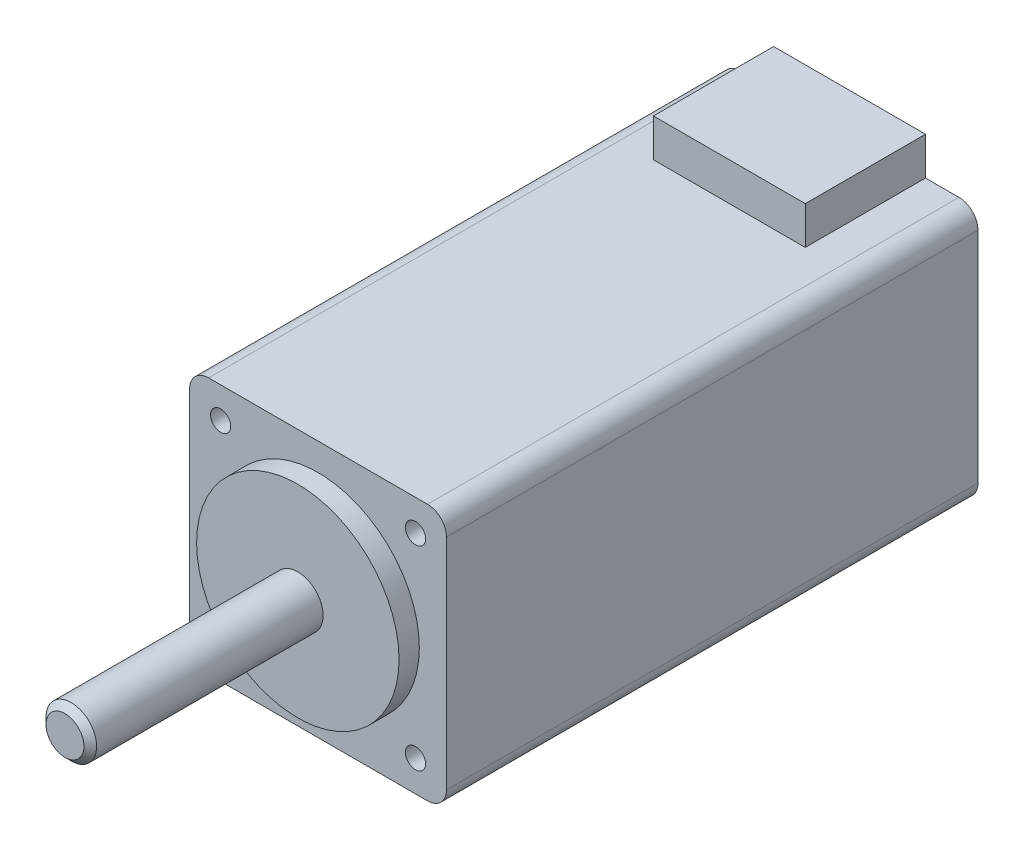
ISO-10303-21;
HEADER;
FILE_DESCRIPTION(('STEP AP214'),'2;1');
FILE_NAME('part.step','',(''),(''),'','','');
FILE_SCHEMA(('AUTOMOTIVE_DESIGN { 1 0 10303 214 1 1 1 1 }'));
ENDSEC;
DATA;
#1=APPLICATION_CONTEXT('core data for automotive mechanical design processes');
#2=APPLICATION_PROTOCOL_DEFINITION('international standard','automotive_design',2000,#1);
#3=PRODUCT_CONTEXT('',#1,'mechanical');
#4=PRODUCT('Part','Part','',(#3));
#5=PRODUCT_RELATED_PRODUCT_CATEGORY('part','',(#4));
#6=PRODUCT_DEFINITION_FORMATION('','',#4);
#7=PRODUCT_DEFINITION_CONTEXT('part definition',#1,'design');
#8=PRODUCT_DEFINITION('design','',#6,#7);
#9=PRODUCT_DEFINITION_SHAPE('','',#8);
#10=(LENGTH_UNIT() NAMED_UNIT(*) SI_UNIT(.MILLI.,.METRE.));
#11=(NAMED_UNIT(*) PLANE_ANGLE_UNIT() SI_UNIT($,.RADIAN.));
#12=(NAMED_UNIT(*) SI_UNIT($,.STERADIAN.) SOLID_ANGLE_UNIT());
#13=UNCERTAINTY_MEASURE_WITH_UNIT(LENGTH_MEASURE(1.E-05),#10,'distance_accuracy_value','');
#14=(GEOMETRIC_REPRESENTATION_CONTEXT(3) GLOBAL_UNCERTAINTY_ASSIGNED_CONTEXT((#13)) GLOBAL_UNIT_ASSIGNED_CONTEXT((#10,
#11,#12)) REPRESENTATION_CONTEXT('',''));
#15=CARTESIAN_POINT('',(0.,0.,0.));
#16=DIRECTION('',(0.,0.,1.));
#17=DIRECTION('',(1.,0.,0.));
#18=AXIS2_PLACEMENT_3D('',#15,#16,#17);
#19=CARTESIAN_POINT('',(0.,0.,0.));
#20=DIRECTION('',(0.,0.,1.));
#21=DIRECTION('',(1.,0.,0.));
#22=AXIS2_PLACEMENT_3D('',#19,#20,#21);
#23=PLANE('',#22);
#24=CARTESIAN_POINT('',(0.,0.,0.));
#25=DIRECTION('',(0.,0.,1.));
#26=DIRECTION('',(1.,0.,0.));
#27=AXIS2_PLACEMENT_3D('',#24,#25,#26);
#28=CIRCLE('',#27,8.);
#29=CARTESIAN_POINT('',(8.,0.,0.));
#30=VERTEX_POINT('',#29);
#31=EDGE_CURVE('E184',#30,#30,#28,.T.);
#32=ORIENTED_EDGE('',*,*,#31,.T.);
#33=EDGE_LOOP('',(#32));
#34=FACE_BOUND('',#33,.T.);
#35=CARTESIAN_POINT('',(0.,0.,0.));
#36=DIRECTION('',(0.,0.,1.));
#37=DIRECTION('',(1.,0.,0.));
#38=AXIS2_PLACEMENT_3D('',#35,#36,#37);
#39=CIRCLE('',#38,2.);
#40=CARTESIAN_POINT('',(2.,0.,0.));
#41=VERTEX_POINT('',#40);
#42=EDGE_CURVE('E181',#41,#41,#39,.T.);
#43=ORIENTED_EDGE('',*,*,#42,.F.);
#44=EDGE_LOOP('',(#43));
#45=FACE_BOUND('',#44,.T.);
#46=ADVANCED_FACE('F37',(#34,#45),#23,.T.);
#47=CARTESIAN_POINT('',(0.,0.,-1.6));
#48=DIRECTION('',(0.,0.,1.));
#49=DIRECTION('',(1.,0.,0.));
#50=AXIS2_PLACEMENT_3D('',#47,#48,#49);
#51=CYLINDRICAL_SURFACE('',#50,8.);
#52=CARTESIAN_POINT('',(0.,0.,-1.6));
#53=DIRECTION('',(0.,0.,1.));
#54=DIRECTION('',(1.,0.,0.));
#55=AXIS2_PLACEMENT_3D('',#52,#53,#54);
#56=CIRCLE('',#55,8.);
#57=CARTESIAN_POINT('',(8.,0.,-1.6));
#58=VERTEX_POINT('',#57);
#59=EDGE_CURVE('E178',#58,#58,#56,.F.);
#60=ORIENTED_EDGE('',*,*,#59,.F.);
#61=EDGE_LOOP('',(#60));
#62=FACE_BOUND('',#61,.T.);
#63=ORIENTED_EDGE('',*,*,#31,.F.);
#64=EDGE_LOOP('',(#63));
#65=FACE_BOUND('',#64,.T.);
#66=ADVANCED_FACE('F205',(#62,#65),#51,.T.);
#67=CARTESIAN_POINT('',(0.,0.,18.4));
#68=DIRECTION('',(0.,0.,-1.));
#69=DIRECTION('',(-1.,0.,0.));
#70=AXIS2_PLACEMENT_3D('',#67,#68,#69);
#71=CYLINDRICAL_SURFACE('',#70,2.);
#72=CARTESIAN_POINT('',(0.,0.,17.9));
#73=DIRECTION('',(0.,0.,1.));
#74=DIRECTION('',(1.,0.,0.));
#75=AXIS2_PLACEMENT_3D('',#72,#73,#74);
#76=CIRCLE('',#75,2.);
#77=CARTESIAN_POINT('',(2.,0.,17.9));
#78=VERTEX_POINT('',#77);
#79=EDGE_CURVE('E11',#78,#78,#76,.F.);
#80=ORIENTED_EDGE('',*,*,#79,.T.);
#81=EDGE_LOOP('',(#80));
#82=FACE_BOUND('',#81,.T.);
#83=ORIENTED_EDGE('',*,*,#42,.T.);
#84=EDGE_LOOP('',(#83));
#85=FACE_BOUND('',#84,.T.);
#86=ADVANCED_FACE('F201',(#82,#85),#71,.T.);
#87=CARTESIAN_POINT('',(0.,0.,18.4));
#88=DIRECTION('',(0.,0.,1.));
#89=DIRECTION('',(1.,0.,0.));
#90=AXIS2_PLACEMENT_3D('',#87,#88,#89);
#91=PLANE('',#90);
#92=CARTESIAN_POINT('',(0.,0.,18.4));
#93=DIRECTION('',(0.,0.,1.));
#94=DIRECTION('',(1.,0.,0.));
#95=AXIS2_PLACEMENT_3D('',#92,#93,#94);
#96=CIRCLE('',#95,1.5);
#97=CARTESIAN_POINT('',(1.5,0.,18.4));
#98=VERTEX_POINT('',#97);
#99=EDGE_CURVE('E45',#98,#98,#96,.T.);
#100=ORIENTED_EDGE('',*,*,#99,.T.);
#101=EDGE_LOOP('',(#100));
#102=FACE_BOUND('',#101,.T.);
#103=ADVANCED_FACE('F189',(#102),#91,.T.);
#104=CARTESIAN_POINT('',(0.,0.,18.4));
#105=DIRECTION('',(0.,0.,-1.));
#106=DIRECTION('',(-1.,0.,0.));
#107=AXIS2_PLACEMENT_3D('',#104,#105,#106);
#108=CONICAL_SURFACE('',#107,1.5,0.78539816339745);
#109=ORIENTED_EDGE('',*,*,#79,.F.);
#110=EDGE_LOOP('',(#109));
#111=FACE_BOUND('',#110,.T.);
#112=ORIENTED_EDGE('',*,*,#99,.F.);
#113=EDGE_LOOP('',(#112));
#114=FACE_BOUND('',#113,.T.);
#115=ADVANCED_FACE('F39',(#111,#114),#108,.T.);
#116=CARTESIAN_POINT('',(8.65,8.65,-43.6));
#117=DIRECTION('',(0.,0.,1.));
#118=DIRECTION('',(1.,0.,0.));
#119=AXIS2_PLACEMENT_3D('',#116,#117,#118);
#120=CYLINDRICAL_SURFACE('',#119,1.5);
#121=CARTESIAN_POINT('',(8.65,8.65,-1.6));
#122=DIRECTION('',(0.,0.,-1.));
#123=DIRECTION('',(1.,0.,0.));
#124=AXIS2_PLACEMENT_3D('',#121,#122,#123);
#125=CIRCLE('',#124,1.5);
#126=CARTESIAN_POINT('',(8.64999999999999,10.15,-1.6));
#127=VERTEX_POINT('',#126);
#128=CARTESIAN_POINT('',(10.15,8.64999999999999,-1.6));
#129=VERTEX_POINT('',#128);
#130=EDGE_CURVE('E148',#127,#129,#125,.T.);
#131=ORIENTED_EDGE('',*,*,#130,.T.);
#132=DIRECTION('',(0.,0.,1.));
#133=VECTOR('',#132,1.);
#134=CARTESIAN_POINT('',(10.15,8.64999999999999,-43.6));
#135=LINE('',#134,#133);
#136=CARTESIAN_POINT('',(10.15,8.64999999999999,-43.6));
#137=VERTEX_POINT('',#136);
#138=EDGE_CURVE('E172',#137,#129,#135,.T.);
#139=ORIENTED_EDGE('',*,*,#138,.F.);
#140=CARTESIAN_POINT('',(8.65,8.65,-43.6));
#141=DIRECTION('',(0.,0.,-1.));
#142=DIRECTION('',(1.,0.,0.));
#143=AXIS2_PLACEMENT_3D('',#140,#141,#142);
#144=CIRCLE('',#143,1.5);
#145=CARTESIAN_POINT('',(8.64999999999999,10.15,-43.6));
#146=VERTEX_POINT('',#145);
#147=EDGE_CURVE('E349',#146,#137,#144,.T.);
#148=ORIENTED_EDGE('',*,*,#147,.F.);
#149=DIRECTION('',(0.,0.,1.));
#150=VECTOR('',#149,1.);
#151=CARTESIAN_POINT('',(8.64999999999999,10.15,-43.6));
#152=LINE('',#151,#150);
#153=EDGE_CURVE('E175',#146,#127,#152,.T.);
#154=ORIENTED_EDGE('',*,*,#153,.T.);
#155=EDGE_LOOP('',(#131,#139,#148,#154));
#156=FACE_BOUND('',#155,.T.);
#157=ADVANCED_FACE('F192',(#156),#120,.T.);
#158=CARTESIAN_POINT('',(10.15,-8.65,-43.6));
#159=DIRECTION('',(-1.,0.,0.));
#160=DIRECTION('',(0.,0.,1.));
#161=AXIS2_PLACEMENT_3D('',#158,#159,#160);
#162=PLANE('',#161);
#163=DIRECTION('',(0.,-1.,0.));
#164=VECTOR('',#163,1.);
#165=CARTESIAN_POINT('',(10.15,-8.65,-1.6));
#166=LINE('',#165,#164);
#167=CARTESIAN_POINT('',(10.15,-8.65,-1.6));
#168=VERTEX_POINT('',#167);
#169=EDGE_CURVE('E150',#129,#168,#166,.T.);
#170=ORIENTED_EDGE('',*,*,#169,.T.);
#171=DIRECTION('',(0.,0.,1.));
#172=VECTOR('',#171,1.);
#173=CARTESIAN_POINT('',(10.15,-8.65,-43.6));
#174=LINE('',#173,#172);
#175=CARTESIAN_POINT('',(10.15,-8.65,-43.6));
#176=VERTEX_POINT('',#175);
#177=EDGE_CURVE('E169',#176,#168,#174,.T.);
#178=ORIENTED_EDGE('',*,*,#177,.F.);
#179=DIRECTION('',(0.,-1.,0.));
#180=VECTOR('',#179,1.);
#181=CARTESIAN_POINT('',(10.15,-8.65,-43.6));
#182=LINE('',#181,#180);
#183=EDGE_CURVE('E351',#137,#176,#182,.T.);
#184=ORIENTED_EDGE('',*,*,#183,.F.);
#185=ORIENTED_EDGE('',*,*,#138,.T.);
#186=EDGE_LOOP('',(#170,#178,#184,#185));
#187=FACE_BOUND('',#186,.T.);
#188=ADVANCED_FACE('F198',(#187),#162,.F.);
#189=CARTESIAN_POINT('',(8.65,-8.65000000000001,-43.6));
#190=DIRECTION('',(0.,0.,1.));
#191=DIRECTION('',(1.,0.,0.));
#192=AXIS2_PLACEMENT_3D('',#189,#190,#191);
#193=CYLINDRICAL_SURFACE('',#192,1.5);
#194=CARTESIAN_POINT('',(8.65,-8.65000000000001,-1.6));
#195=DIRECTION('',(0.,0.,-1.));
#196=DIRECTION('',(1.,0.,0.));
#197=AXIS2_PLACEMENT_3D('',#194,#195,#196);
#198=CIRCLE('',#197,1.5);
#199=CARTESIAN_POINT('',(8.64999999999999,-10.15,-1.6));
#200=VERTEX_POINT('',#199);
#201=EDGE_CURVE('E153',#168,#200,#198,.T.);
#202=ORIENTED_EDGE('',*,*,#201,.T.);
#203=DIRECTION('',(0.,0.,1.));
#204=VECTOR('',#203,1.);
#205=CARTESIAN_POINT('',(8.64999999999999,-10.15,-43.6));
#206=LINE('',#205,#204);
#207=CARTESIAN_POINT('',(8.64999999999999,-10.15,-43.6));
#208=VERTEX_POINT('',#207);
#209=EDGE_CURVE('E166',#208,#200,#206,.T.);
#210=ORIENTED_EDGE('',*,*,#209,.F.);
#211=CARTESIAN_POINT('',(8.65,-8.65000000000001,-43.6));
#212=DIRECTION('',(0.,0.,-1.));
#213=DIRECTION('',(1.,0.,0.));
#214=AXIS2_PLACEMENT_3D('',#211,#212,#213);
#215=CIRCLE('',#214,1.5);
#216=EDGE_CURVE('E353',#176,#208,#215,.T.);
#217=ORIENTED_EDGE('',*,*,#216,.F.);
#218=ORIENTED_EDGE('',*,*,#177,.T.);
#219=EDGE_LOOP('',(#202,#210,#217,#218));
#220=FACE_BOUND('',#219,.T.);
#221=ADVANCED_FACE('F219',(#220),#193,.T.);
#222=CARTESIAN_POINT('',(-8.64999999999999,-10.15,-43.6));
#223=DIRECTION('',(0.,1.,0.));
#224=DIRECTION('',(-1.,0.,0.));
#225=AXIS2_PLACEMENT_3D('',#222,#223,#224);
#226=PLANE('',#225);
#227=DIRECTION('',(-1.,0.,0.));
#228=VECTOR('',#227,1.);
#229=CARTESIAN_POINT('',(-8.64999999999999,-10.15,-1.6));
#230=LINE('',#229,#228);
#231=CARTESIAN_POINT('',(-8.64999999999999,-10.15,-1.6));
#232=VERTEX_POINT('',#231);
#233=EDGE_CURVE('E155',#200,#232,#230,.T.);
#234=ORIENTED_EDGE('',*,*,#233,.T.);
#235=DIRECTION('',(0.,0.,1.));
#236=VECTOR('',#235,1.);
#237=CARTESIAN_POINT('',(-8.64999999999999,-10.15,-43.6));
#238=LINE('',#237,#236);
#239=CARTESIAN_POINT('',(-8.64999999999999,-10.15,-43.6));
#240=VERTEX_POINT('',#239);
#241=EDGE_CURVE('E137',#240,#232,#238,.T.);
#242=ORIENTED_EDGE('',*,*,#241,.F.);
#243=DIRECTION('',(-1.,0.,0.));
#244=VECTOR('',#243,1.);
#245=CARTESIAN_POINT('',(-8.64999999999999,-10.15,-43.6));
#246=LINE('',#245,#244);
#247=EDGE_CURVE('E125',#208,#240,#246,.T.);
#248=ORIENTED_EDGE('',*,*,#247,.F.);
#249=ORIENTED_EDGE('',*,*,#209,.T.);
#250=EDGE_LOOP('',(#234,#242,#248,#249));
#251=FACE_BOUND('',#250,.T.);
#252=ADVANCED_FACE('F223',(#251),#226,.F.);
#253=CARTESIAN_POINT('',(-8.65,-8.65,-43.6));
#254=DIRECTION('',(0.,0.,1.));
#255=DIRECTION('',(1.,0.,0.));
#256=AXIS2_PLACEMENT_3D('',#253,#254,#255);
#257=CYLINDRICAL_SURFACE('',#256,1.5);
#258=CARTESIAN_POINT('',(-8.65,-8.65,-1.6));
#259=DIRECTION('',(0.,0.,-1.));
#260=DIRECTION('',(1.,0.,0.));
#261=AXIS2_PLACEMENT_3D('',#258,#259,#260);
#262=CIRCLE('',#261,1.5);
#263=CARTESIAN_POINT('',(-10.15,-8.64999999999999,-1.6));
#264=VERTEX_POINT('',#263);
#265=EDGE_CURVE('E134',#232,#264,#262,.T.);
#266=ORIENTED_EDGE('',*,*,#265,.T.);
#267=DIRECTION('',(0.,0.,1.));
#268=VECTOR('',#267,1.);
#269=CARTESIAN_POINT('',(-10.15,-8.64999999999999,-43.6));
#270=LINE('',#269,#268);
#271=CARTESIAN_POINT('',(-10.15,-8.64999999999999,-43.6));
#272=VERTEX_POINT('',#271);
#273=EDGE_CURVE('E131',#272,#264,#270,.T.);
#274=ORIENTED_EDGE('',*,*,#273,.F.);
#275=CARTESIAN_POINT('',(-8.65,-8.65,-43.6));
#276=DIRECTION('',(0.,0.,-1.));
#277=DIRECTION('',(1.,0.,0.));
#278=AXIS2_PLACEMENT_3D('',#275,#276,#277);
#279=CIRCLE('',#278,1.5);
#280=EDGE_CURVE('E118',#240,#272,#279,.T.);
#281=ORIENTED_EDGE('',*,*,#280,.F.);
#282=ORIENTED_EDGE('',*,*,#241,.T.);
#283=EDGE_LOOP('',(#266,#274,#281,#282));
#284=FACE_BOUND('',#283,.T.);
#285=ADVANCED_FACE('F132',(#284),#257,.T.);
#286=CARTESIAN_POINT('',(-10.15,8.64999999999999,-43.6));
#287=DIRECTION('',(1.,0.,0.));
#288=DIRECTION('',(0.,1.,0.));
#289=AXIS2_PLACEMENT_3D('',#286,#287,#288);
#290=PLANE('',#289);
#291=DIRECTION('',(0.,1.,0.));
#292=VECTOR('',#291,1.);
#293=CARTESIAN_POINT('',(-10.15,8.64999999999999,-1.6));
#294=LINE('',#293,#292);
#295=CARTESIAN_POINT('',(-10.15,8.64999999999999,-1.6));
#296=VERTEX_POINT('',#295);
#297=EDGE_CURVE('E158',#264,#296,#294,.T.);
#298=ORIENTED_EDGE('',*,*,#297,.T.);
#299=DIRECTION('',(0.,0.,1.));
#300=VECTOR('',#299,1.);
#301=CARTESIAN_POINT('',(-10.15,8.64999999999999,-43.6));
#302=LINE('',#301,#300);
#303=CARTESIAN_POINT('',(-10.15,8.64999999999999,-43.6));
#304=VERTEX_POINT('',#303);
#305=EDGE_CURVE('E138',#304,#296,#302,.T.);
#306=ORIENTED_EDGE('',*,*,#305,.F.);
#307=DIRECTION('',(0.,1.,0.));
#308=VECTOR('',#307,1.);
#309=CARTESIAN_POINT('',(-10.15,8.64999999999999,-43.6));
#310=LINE('',#309,#308);
#311=EDGE_CURVE('E122',#272,#304,#310,.T.);
#312=ORIENTED_EDGE('',*,*,#311,.F.);
#313=ORIENTED_EDGE('',*,*,#273,.T.);
#314=EDGE_LOOP('',(#298,#306,#312,#313));
#315=FACE_BOUND('',#314,.T.);
#316=ADVANCED_FACE('F140',(#315),#290,.F.);
#317=CARTESIAN_POINT('',(-8.65,8.65,-43.6));
#318=DIRECTION('',(0.,0.,1.));
#319=DIRECTION('',(1.,0.,0.));
#320=AXIS2_PLACEMENT_3D('',#317,#318,#319);
#321=CYLINDRICAL_SURFACE('',#320,1.5);
#322=CARTESIAN_POINT('',(-8.65,8.65,-1.6));
#323=DIRECTION('',(0.,0.,-1.));
#324=DIRECTION('',(1.,0.,0.));
#325=AXIS2_PLACEMENT_3D('',#322,#323,#324);
#326=CIRCLE('',#325,1.5);
#327=CARTESIAN_POINT('',(-8.64999999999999,10.15,-1.6));
#328=VERTEX_POINT('',#327);
#329=EDGE_CURVE('E96',#296,#328,#326,.T.);
#330=ORIENTED_EDGE('',*,*,#329,.T.);
#331=DIRECTION('',(0.,0.,1.));
#332=VECTOR('',#331,1.);
#333=CARTESIAN_POINT('',(-8.64999999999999,10.15,-43.6));
#334=LINE('',#333,#332);
#335=CARTESIAN_POINT('',(-8.64999999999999,10.15,-43.6));
#336=VERTEX_POINT('',#335);
#337=EDGE_CURVE('E144',#336,#328,#334,.T.);
#338=ORIENTED_EDGE('',*,*,#337,.F.);
#339=CARTESIAN_POINT('',(-8.65,8.65,-43.6));
#340=DIRECTION('',(0.,0.,-1.));
#341=DIRECTION('',(1.,0.,0.));
#342=AXIS2_PLACEMENT_3D('',#339,#340,#341);
#343=CIRCLE('',#342,1.5);
#344=EDGE_CURVE('E142',#304,#336,#343,.T.);
#345=ORIENTED_EDGE('',*,*,#344,.F.);
#346=ORIENTED_EDGE('',*,*,#305,.T.);
#347=EDGE_LOOP('',(#330,#338,#345,#346));
#348=FACE_BOUND('',#347,.T.);
#349=ADVANCED_FACE('F232',(#348),#321,.T.);
#350=CARTESIAN_POINT('',(0.,10.15,-43.6));
#351=DIRECTION('',(0.,-1.,0.));
#352=DIRECTION('',(0.,0.,-1.));
#353=AXIS2_PLACEMENT_3D('',#350,#351,#352);
#354=PLANE('',#353);
#355=DIRECTION('',(1.,0.,0.));
#356=VECTOR('',#355,1.);
#357=CARTESIAN_POINT('',(8.64999999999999,10.15,-43.6));
#358=LINE('',#357,#356);
#359=CARTESIAN_POINT('',(6.,10.15,-43.6));
#360=VERTEX_POINT('',#359);
#361=EDGE_CURVE('E101',#360,#146,#358,.T.);
#362=ORIENTED_EDGE('',*,*,#361,.F.);
#363=DIRECTION('',(0.,0.,-1.));
#364=VECTOR('',#363,1.);
#365=CARTESIAN_POINT('',(6.,10.15,-34.1));
#366=LINE('',#365,#364);
#367=CARTESIAN_POINT('',(6.,10.15,-34.1));
#368=VERTEX_POINT('',#367);
#369=EDGE_CURVE('E151',#368,#360,#366,.T.);
#370=ORIENTED_EDGE('',*,*,#369,.F.);
#371=DIRECTION('',(-1.,0.,0.));
#372=VECTOR('',#371,1.);
#373=CARTESIAN_POINT('',(6.,10.15,-34.1));
#374=LINE('',#373,#372);
#375=CARTESIAN_POINT('',(-6.,10.15,-34.1));
#376=VERTEX_POINT('',#375);
#377=EDGE_CURVE('E322',#368,#376,#374,.T.);
#378=ORIENTED_EDGE('',*,*,#377,.T.);
#379=DIRECTION('',(0.,0.,-1.));
#380=VECTOR('',#379,1.);
#381=CARTESIAN_POINT('',(-6.,10.15,-34.1));
#382=LINE('',#381,#380);
#383=CARTESIAN_POINT('',(-6.,10.15,-43.6));
#384=VERTEX_POINT('',#383);
#385=EDGE_CURVE('E334',#376,#384,#382,.T.);
#386=ORIENTED_EDGE('',*,*,#385,.T.);
#387=EDGE_CURVE('E61',#336,#384,#358,.T.);
#388=ORIENTED_EDGE('',*,*,#387,.F.);
#389=ORIENTED_EDGE('',*,*,#337,.T.);
#390=DIRECTION('',(1.,0.,0.));
#391=VECTOR('',#390,1.);
#392=CARTESIAN_POINT('',(0.,10.15,-1.6));
#393=LINE('',#392,#391);
#394=EDGE_CURVE('E161',#328,#127,#393,.T.);
#395=ORIENTED_EDGE('',*,*,#394,.T.);
#396=ORIENTED_EDGE('',*,*,#153,.F.);
#397=EDGE_LOOP('',(#362,#370,#378,#386,#388,#389,#395,#396));
#398=FACE_BOUND('',#397,.T.);
#399=ADVANCED_FACE('F235',(#398),#354,.F.);
#400=CARTESIAN_POINT('',(-8.65,8.65,-43.6));
#401=DIRECTION('',(0.,0.,1.));
#402=DIRECTION('',(1.,0.,0.));
#403=AXIS2_PLACEMENT_3D('',#400,#401,#402);
#404=PLANE('',#403);
#405=ORIENTED_EDGE('',*,*,#387,.T.);
#406=DIRECTION('',(0.,1.,0.));
#407=VECTOR('',#406,1.);
#408=CARTESIAN_POINT('',(-6.,10.15,-43.6));
#409=LINE('',#408,#407);
#410=CARTESIAN_POINT('',(-6.,13.15,-43.6));
#411=VERTEX_POINT('',#410);
#412=EDGE_CURVE('E321',#384,#411,#409,.T.);
#413=ORIENTED_EDGE('',*,*,#412,.T.);
#414=DIRECTION('',(1.,0.,0.));
#415=VECTOR('',#414,1.);
#416=CARTESIAN_POINT('',(-6.,13.15,-43.6));
#417=LINE('',#416,#415);
#418=CARTESIAN_POINT('',(6.,13.15,-43.6));
#419=VERTEX_POINT('',#418);
#420=EDGE_CURVE('E337',#411,#419,#417,.T.);
#421=ORIENTED_EDGE('',*,*,#420,.T.);
#422=DIRECTION('',(0.,-1.,0.));
#423=VECTOR('',#422,1.);
#424=CARTESIAN_POINT('',(6.,13.15,-43.6));
#425=LINE('',#424,#423);
#426=EDGE_CURVE('E52',#419,#360,#425,.T.);
#427=ORIENTED_EDGE('',*,*,#426,.T.);
#428=ORIENTED_EDGE('',*,*,#361,.T.);
#429=ORIENTED_EDGE('',*,*,#147,.T.);
#430=ORIENTED_EDGE('',*,*,#183,.T.);
#431=ORIENTED_EDGE('',*,*,#216,.T.);
#432=ORIENTED_EDGE('',*,*,#247,.T.);
#433=ORIENTED_EDGE('',*,*,#280,.T.);
#434=ORIENTED_EDGE('',*,*,#311,.T.);
#435=ORIENTED_EDGE('',*,*,#344,.T.);
#436=EDGE_LOOP('',(#405,#413,#421,#427,#428,#429,#430,#431,#432,#433,#434,#435));
#437=FACE_BOUND('',#436,.T.);
#438=ADVANCED_FACE('F120',(#437),#404,.F.);
#439=CARTESIAN_POINT('',(-8.65,8.65,-1.6));
#440=DIRECTION('',(0.,0.,1.));
#441=DIRECTION('',(1.,0.,0.));
#442=AXIS2_PLACEMENT_3D('',#439,#440,#441);
#443=PLANE('',#442);
#444=CARTESIAN_POINT('',(-7.7,7.7,-1.6));
#445=DIRECTION('',(0.,0.,1.));
#446=DIRECTION('',(1.,0.,0.));
#447=AXIS2_PLACEMENT_3D('',#444,#445,#446);
#448=CIRCLE('',#447,0.799999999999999);
#449=CARTESIAN_POINT('',(-6.9,7.7,-1.6));
#450=VERTEX_POINT('',#449);
#451=EDGE_CURVE('E299',#450,#450,#448,.T.);
#452=ORIENTED_EDGE('',*,*,#451,.F.);
#453=EDGE_LOOP('',(#452));
#454=FACE_BOUND('',#453,.T.);
#455=CARTESIAN_POINT('',(7.7,7.7,-1.6));
#456=DIRECTION('',(0.,0.,1.));
#457=DIRECTION('',(1.,0.,0.));
#458=AXIS2_PLACEMENT_3D('',#455,#456,#457);
#459=CIRCLE('',#458,0.799999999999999);
#460=CARTESIAN_POINT('',(8.5,7.7,-1.6));
#461=VERTEX_POINT('',#460);
#462=EDGE_CURVE('E301',#461,#461,#459,.T.);
#463=ORIENTED_EDGE('',*,*,#462,.F.);
#464=EDGE_LOOP('',(#463));
#465=FACE_BOUND('',#464,.T.);
#466=CARTESIAN_POINT('',(7.7,-7.7,-1.6));
#467=DIRECTION('',(0.,0.,1.));
#468=DIRECTION('',(1.,0.,0.));
#469=AXIS2_PLACEMENT_3D('',#466,#467,#468);
#470=CIRCLE('',#469,0.799999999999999);
#471=CARTESIAN_POINT('',(8.5,-7.7,-1.6));
#472=VERTEX_POINT('',#471);
#473=EDGE_CURVE('E309',#472,#472,#470,.T.);
#474=ORIENTED_EDGE('',*,*,#473,.F.);
#475=EDGE_LOOP('',(#474));
#476=FACE_BOUND('',#475,.T.);
#477=CARTESIAN_POINT('',(-7.7,-7.7,-1.6));
#478=DIRECTION('',(0.,0.,1.));
#479=DIRECTION('',(1.,0.,0.));
#480=AXIS2_PLACEMENT_3D('',#477,#478,#479);
#481=CIRCLE('',#480,0.799999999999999);
#482=CARTESIAN_POINT('',(-6.9,-7.7,-1.6));
#483=VERTEX_POINT('',#482);
#484=EDGE_CURVE('E315',#483,#483,#481,.T.);
#485=ORIENTED_EDGE('',*,*,#484,.F.);
#486=EDGE_LOOP('',(#485));
#487=FACE_BOUND('',#486,.T.);
#488=ORIENTED_EDGE('',*,*,#59,.T.);
#489=EDGE_LOOP('',(#488));
#490=FACE_BOUND('',#489,.T.);
#491=ORIENTED_EDGE('',*,*,#130,.F.);
#492=ORIENTED_EDGE('',*,*,#394,.F.);
#493=ORIENTED_EDGE('',*,*,#329,.F.);
#494=ORIENTED_EDGE('',*,*,#297,.F.);
#495=ORIENTED_EDGE('',*,*,#265,.F.);
#496=ORIENTED_EDGE('',*,*,#233,.F.);
#497=ORIENTED_EDGE('',*,*,#201,.F.);
#498=ORIENTED_EDGE('',*,*,#169,.F.);
#499=EDGE_LOOP('',(#491,#492,#493,#494,#495,#496,#497,#498));
#500=FACE_BOUND('',#499,.T.);
#501=ADVANCED_FACE('F238',(#454,#465,#476,#487,#490,#500),#443,.T.);
#502=CARTESIAN_POINT('',(6.,13.15,-34.1));
#503=DIRECTION('',(1.,0.,0.));
#504=DIRECTION('',(0.,1.,0.));
#505=AXIS2_PLACEMENT_3D('',#502,#503,#504);
#506=PLANE('',#505);
#507=ORIENTED_EDGE('',*,*,#426,.F.);
#508=DIRECTION('',(0.,0.,-1.));
#509=VECTOR('',#508,1.);
#510=CARTESIAN_POINT('',(6.,13.15,-34.1));
#511=LINE('',#510,#509);
#512=CARTESIAN_POINT('',(6.,13.15,-34.1));
#513=VERTEX_POINT('',#512);
#514=EDGE_CURVE('E341',#513,#419,#511,.T.);
#515=ORIENTED_EDGE('',*,*,#514,.F.);
#516=DIRECTION('',(0.,-1.,0.));
#517=VECTOR('',#516,1.);
#518=CARTESIAN_POINT('',(6.,13.15,-34.1));
#519=LINE('',#518,#517);
#520=EDGE_CURVE('E331',#513,#368,#519,.T.);
#521=ORIENTED_EDGE('',*,*,#520,.T.);
#522=ORIENTED_EDGE('',*,*,#369,.T.);
#523=EDGE_LOOP('',(#507,#515,#521,#522));
#524=FACE_BOUND('',#523,.T.);
#525=ADVANCED_FACE('F241',(#524),#506,.T.);
#526=CARTESIAN_POINT('',(-6.,13.15,-34.1));
#527=DIRECTION('',(0.,1.,0.));
#528=DIRECTION('',(-1.,0.,0.));
#529=AXIS2_PLACEMENT_3D('',#526,#527,#528);
#530=PLANE('',#529);
#531=ORIENTED_EDGE('',*,*,#420,.F.);
#532=DIRECTION('',(0.,0.,-1.));
#533=VECTOR('',#532,1.);
#534=CARTESIAN_POINT('',(-6.,13.15,-34.1));
#535=LINE('',#534,#533);
#536=CARTESIAN_POINT('',(-6.,13.15,-34.1));
#537=VERTEX_POINT('',#536);
#538=EDGE_CURVE('E344',#537,#411,#535,.T.);
#539=ORIENTED_EDGE('',*,*,#538,.F.);
#540=DIRECTION('',(1.,0.,0.));
#541=VECTOR('',#540,1.);
#542=CARTESIAN_POINT('',(-6.,13.15,-34.1));
#543=LINE('',#542,#541);
#544=EDGE_CURVE('E328',#537,#513,#543,.T.);
#545=ORIENTED_EDGE('',*,*,#544,.T.);
#546=ORIENTED_EDGE('',*,*,#514,.T.);
#547=EDGE_LOOP('',(#531,#539,#545,#546));
#548=FACE_BOUND('',#547,.T.);
#549=ADVANCED_FACE('F249',(#548),#530,.T.);
#550=CARTESIAN_POINT('',(-6.,10.15,-34.1));
#551=DIRECTION('',(-1.,0.,0.));
#552=DIRECTION('',(0.,0.,1.));
#553=AXIS2_PLACEMENT_3D('',#550,#551,#552);
#554=PLANE('',#553);
#555=ORIENTED_EDGE('',*,*,#412,.F.);
#556=ORIENTED_EDGE('',*,*,#385,.F.);
#557=DIRECTION('',(0.,1.,0.));
#558=VECTOR('',#557,1.);
#559=CARTESIAN_POINT('',(-6.,10.15,-34.1));
#560=LINE('',#559,#558);
#561=EDGE_CURVE('E325',#376,#537,#560,.T.);
#562=ORIENTED_EDGE('',*,*,#561,.T.);
#563=ORIENTED_EDGE('',*,*,#538,.T.);
#564=EDGE_LOOP('',(#555,#556,#562,#563));
#565=FACE_BOUND('',#564,.T.);
#566=ADVANCED_FACE('F245',(#565),#554,.T.);
#567=CARTESIAN_POINT('',(0.,0.,-34.1));
#568=DIRECTION('',(0.,0.,-1.));
#569=DIRECTION('',(-1.,0.,0.));
#570=AXIS2_PLACEMENT_3D('',#567,#568,#569);
#571=PLANE('',#570);
#572=ORIENTED_EDGE('',*,*,#377,.F.);
#573=ORIENTED_EDGE('',*,*,#520,.F.);
#574=ORIENTED_EDGE('',*,*,#544,.F.);
#575=ORIENTED_EDGE('',*,*,#561,.F.);
#576=EDGE_LOOP('',(#572,#573,#574,#575));
#577=FACE_BOUND('',#576,.T.);
#578=ADVANCED_FACE('F248',(#577),#571,.F.);
#579=CARTESIAN_POINT('',(-7.7,-7.7,-7.1));
#580=DIRECTION('',(0.,0.,1.));
#581=DIRECTION('',(1.,0.,0.));
#582=AXIS2_PLACEMENT_3D('',#579,#580,#581);
#583=CONICAL_SURFACE('',#582,0.799999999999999,1.02974425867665);
#584=CARTESIAN_POINT('',(-7.7,-7.7,-7.58068849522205));
#585=VERTEX_POINT('',#584);
#586=VERTEX_LOOP('',#585);
#587=FACE_BOUND('',#586,.T.);
#588=CARTESIAN_POINT('',(-7.7,-7.7,-7.1));
#589=DIRECTION('',(0.,0.,1.));
#590=DIRECTION('',(1.,0.,0.));
#591=AXIS2_PLACEMENT_3D('',#588,#589,#590);
#592=CIRCLE('',#591,0.799999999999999);
#593=CARTESIAN_POINT('',(-6.9,-7.7,-7.1));
#594=VERTEX_POINT('',#593);
#595=EDGE_CURVE('E318',#594,#594,#592,.T.);
#596=ORIENTED_EDGE('',*,*,#595,.T.);
#597=EDGE_LOOP('',(#596));
#598=FACE_BOUND('',#597,.T.);
#599=ADVANCED_FACE('F259',(#587,#598),#583,.F.);
#600=CARTESIAN_POINT('',(-7.7,-7.7,-1.6));
#601=DIRECTION('',(0.,0.,1.));
#602=DIRECTION('',(1.,0.,0.));
#603=AXIS2_PLACEMENT_3D('',#600,#601,#602);
#604=CYLINDRICAL_SURFACE('',#603,0.799999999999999);
#605=ORIENTED_EDGE('',*,*,#595,.F.);
#606=EDGE_LOOP('',(#605));
#607=FACE_BOUND('',#606,.T.);
#608=ORIENTED_EDGE('',*,*,#484,.T.);
#609=EDGE_LOOP('',(#608));
#610=FACE_BOUND('',#609,.T.);
#611=ADVANCED_FACE('F263',(#607,#610),#604,.F.);
#612=CARTESIAN_POINT('',(7.7,-7.7,-7.1));
#613=DIRECTION('',(0.,0.,1.));
#614=DIRECTION('',(1.,0.,0.));
#615=AXIS2_PLACEMENT_3D('',#612,#613,#614);
#616=CONICAL_SURFACE('',#615,0.799999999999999,1.02974425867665);
#617=CARTESIAN_POINT('',(7.7,-7.7,-7.58068849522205));
#618=VERTEX_POINT('',#617);
#619=VERTEX_LOOP('',#618);
#620=FACE_BOUND('',#619,.T.);
#621=CARTESIAN_POINT('',(7.7,-7.7,-7.1));
#622=DIRECTION('',(0.,0.,1.));
#623=DIRECTION('',(1.,0.,0.));
#624=AXIS2_PLACEMENT_3D('',#621,#622,#623);
#625=CIRCLE('',#624,0.799999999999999);
#626=CARTESIAN_POINT('',(8.5,-7.7,-7.1));
#627=VERTEX_POINT('',#626);
#628=EDGE_CURVE('E312',#627,#627,#625,.T.);
#629=ORIENTED_EDGE('',*,*,#628,.T.);
#630=EDGE_LOOP('',(#629));
#631=FACE_BOUND('',#630,.T.);
#632=ADVANCED_FACE('F267',(#620,#631),#616,.F.);
#633=CARTESIAN_POINT('',(7.7,-7.7,-1.6));
#634=DIRECTION('',(0.,0.,1.));
#635=DIRECTION('',(1.,0.,0.));
#636=AXIS2_PLACEMENT_3D('',#633,#634,#635);
#637=CYLINDRICAL_SURFACE('',#636,0.799999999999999);
#638=ORIENTED_EDGE('',*,*,#628,.F.);
#639=EDGE_LOOP('',(#638));
#640=FACE_BOUND('',#639,.T.);
#641=ORIENTED_EDGE('',*,*,#473,.T.);
#642=EDGE_LOOP('',(#641));
#643=FACE_BOUND('',#642,.T.);
#644=ADVANCED_FACE('F271',(#640,#643),#637,.F.);
#645=CARTESIAN_POINT('',(7.7,7.7,-7.1));
#646=DIRECTION('',(0.,0.,1.));
#647=DIRECTION('',(1.,0.,0.));
#648=AXIS2_PLACEMENT_3D('',#645,#646,#647);
#649=CONICAL_SURFACE('',#648,0.799999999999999,1.02974425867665);
#650=CARTESIAN_POINT('',(7.7,7.7,-7.58068849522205));
#651=VERTEX_POINT('',#650);
#652=VERTEX_LOOP('',#651);
#653=FACE_BOUND('',#652,.T.);
#654=CARTESIAN_POINT('',(7.7,7.7,-7.1));
#655=DIRECTION('',(0.,0.,1.));
#656=DIRECTION('',(1.,0.,0.));
#657=AXIS2_PLACEMENT_3D('',#654,#655,#656);
#658=CIRCLE('',#657,0.799999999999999);
#659=CARTESIAN_POINT('',(8.5,7.7,-7.1));
#660=VERTEX_POINT('',#659);
#661=EDGE_CURVE('E306',#660,#660,#658,.T.);
#662=ORIENTED_EDGE('',*,*,#661,.T.);
#663=EDGE_LOOP('',(#662));
#664=FACE_BOUND('',#663,.T.);
#665=ADVANCED_FACE('F275',(#653,#664),#649,.F.);
#666=CARTESIAN_POINT('',(7.7,7.7,-1.6));
#667=DIRECTION('',(0.,0.,1.));
#668=DIRECTION('',(1.,0.,0.));
#669=AXIS2_PLACEMENT_3D('',#666,#667,#668);
#670=CYLINDRICAL_SURFACE('',#669,0.799999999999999);
#671=ORIENTED_EDGE('',*,*,#661,.F.);
#672=EDGE_LOOP('',(#671));
#673=FACE_BOUND('',#672,.T.);
#674=ORIENTED_EDGE('',*,*,#462,.T.);
#675=EDGE_LOOP('',(#674));
#676=FACE_BOUND('',#675,.T.);
#677=ADVANCED_FACE('F279',(#673,#676),#670,.F.);
#678=CARTESIAN_POINT('',(-7.7,7.7,-7.1));
#679=DIRECTION('',(0.,0.,1.));
#680=DIRECTION('',(1.,0.,0.));
#681=AXIS2_PLACEMENT_3D('',#678,#679,#680);
#682=CONICAL_SURFACE('',#681,0.799999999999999,1.02974425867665);
#683=CARTESIAN_POINT('',(-7.7,7.7,-7.58068849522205));
#684=VERTEX_POINT('',#683);
#685=VERTEX_LOOP('',#684);
#686=FACE_BOUND('',#685,.T.);
#687=CARTESIAN_POINT('',(-7.7,7.7,-7.1));
#688=DIRECTION('',(0.,0.,1.));
#689=DIRECTION('',(1.,0.,0.));
#690=AXIS2_PLACEMENT_3D('',#687,#688,#689);
#691=CIRCLE('',#690,0.799999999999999);
#692=CARTESIAN_POINT('',(-6.9,7.7,-7.1));
#693=VERTEX_POINT('',#692);
#694=EDGE_CURVE('E296',#693,#693,#691,.T.);
#695=ORIENTED_EDGE('',*,*,#694,.T.);
#696=EDGE_LOOP('',(#695));
#697=FACE_BOUND('',#696,.T.);
#698=ADVANCED_FACE('F283',(#686,#697),#682,.F.);
#699=CARTESIAN_POINT('',(-7.7,7.7,-1.6));
#700=DIRECTION('',(0.,0.,1.));
#701=DIRECTION('',(1.,0.,0.));
#702=AXIS2_PLACEMENT_3D('',#699,#700,#701);
#703=CYLINDRICAL_SURFACE('',#702,0.799999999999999);
#704=ORIENTED_EDGE('',*,*,#694,.F.);
#705=EDGE_LOOP('',(#704));
#706=FACE_BOUND('',#705,.T.);
#707=ORIENTED_EDGE('',*,*,#451,.T.);
#708=EDGE_LOOP('',(#707));
#709=FACE_BOUND('',#708,.T.);
#710=ADVANCED_FACE('F287',(#706,#709),#703,.F.);
#711=CLOSED_SHELL('',(#46,#66,#86,#103,#115,#157,#188,#221,#252,#285,#316,#349,#399,#438,#501,
#525,#549,#566,#578,#599,#611,#632,#644,#665,#677,#698,#710));
#712=MANIFOLD_SOLID_BREP('B2',#711);
#713=ADVANCED_BREP_SHAPE_REPRESENTATION('',(#18,#712),#14);
#714=SHAPE_DEFINITION_REPRESENTATION(#9,#713);
ENDSEC;
END-ISO-10303-21;
